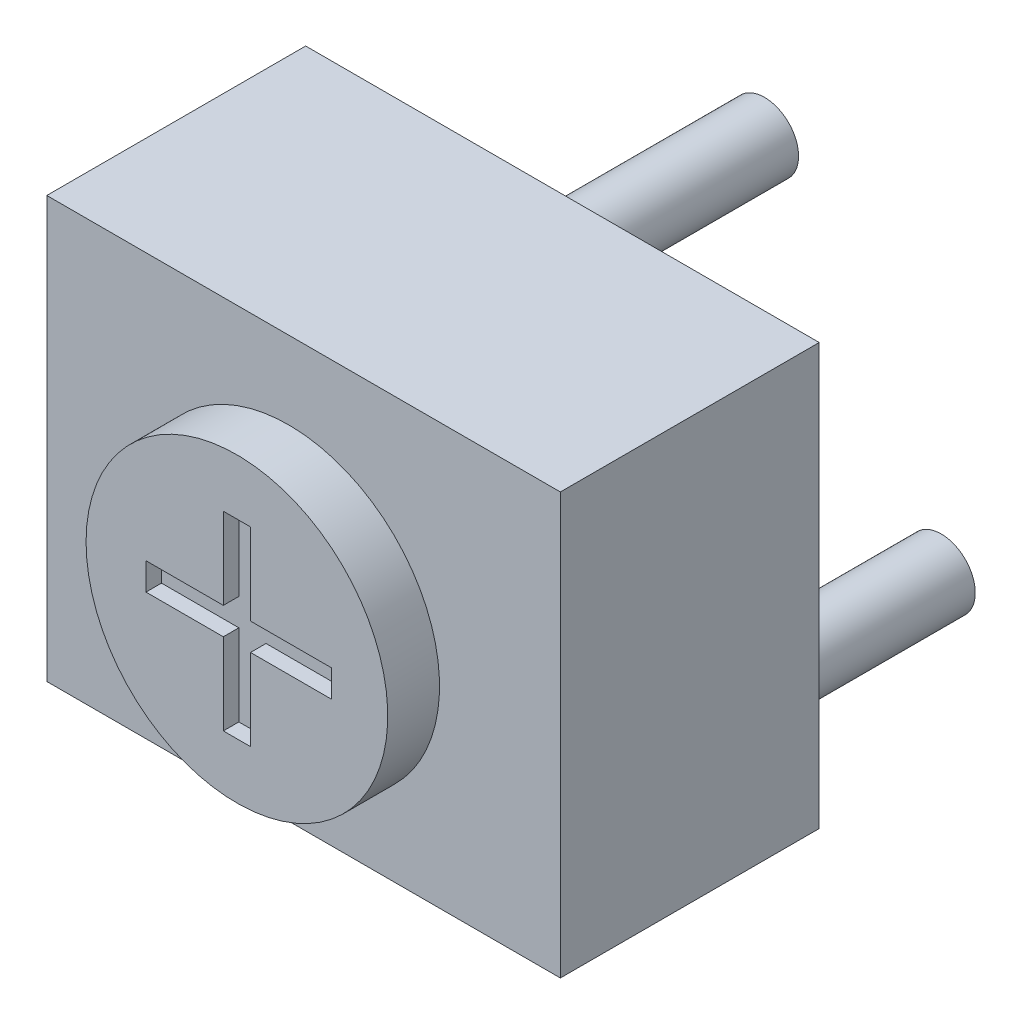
from build123d import *

# Parameters (mm, degrees)
ESQUISSE1_W                  = 7.55848073
ESQUISSE1_H                  = 6.19513229
EXTRUSION1_DEPTH             = 3.81
ESQUISSE2_R                  = 2.220084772
EXTRUSION2_DEPTH             = 0.762
ESQUISSE4_R                  = 0.5
EXTRUSION3_DEPTH             = 1.27
EXTRUSION3_DIRECTION_2_REACH = 55.202
ENL_V_MAT_EXTRU_1_DEPTH      = 0.2286


with BuildPart() as part:
    # Esquisse1 → Extrusion1 (new body)
    with BuildSketch(Plane.XY):
        with Locations((44.528886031, -18.324893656)):
            Rectangle(ESQUISSE1_W, ESQUISSE1_H)
    extrude(amount=EXTRUSION1_DEPTH)

    # Esquisse2 → Extrusion2 (add)
    with BuildSketch(Plane.XY.offset(3.81)):
        with Locations(Location((44.309534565, -18.591196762, 0), (0, 0, 180))):
            Circle(ESQUISSE2_R)
    extrude(amount=EXTRUSION2_DEPTH)

    # Esquisse4 → Extrusion3 (add)
    with BuildSketch(Plane(origin=(0, 0, -1.58), x_dir=(-1, 0, 0), z_dir=(0, 0, -1))):
        with Locations((-41.850277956, -20.119516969)):
            Circle(ESQUISSE4_R)
        with Locations((-44.654481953, -15.85461415)):
            Circle(ESQUISSE4_R)
        with Locations((-47.254559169, -20.119516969)):
            Circle(ESQUISSE4_R)
    extrude(amount=EXTRUSION3_DEPTH)

    # Esquisse4 → Extrusion3 direction 2 (add, up to next)
    with BuildSketch(Plane(origin=(0, 0, -1.58), x_dir=(-1, 0, 0), z_dir=(0, 0, -1)), mode=Mode.PRIVATE) as extrusion3_direction_2_sk1:
        with Locations((-41.850277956, -20.119516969)):
            Circle(ESQUISSE4_R)
    extrusion3_direction_2_tool1 = extrude(extrusion3_direction_2_sk1.sketch, amount=-EXTRUSION3_DIRECTION_2_REACH, mode=Mode.PRIVATE) - part.part
    # Esquisse4 → Extrusion3 direction 2 (add, up to next)
    with BuildSketch(Plane(origin=(0, 0, -1.58), x_dir=(-1, 0, 0), z_dir=(0, 0, -1)), mode=Mode.PRIVATE) as extrusion3_direction_2_sk2:
        with Locations((-44.654481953, -15.85461415)):
            Circle(ESQUISSE4_R)
    extrusion3_direction_2_tool2 = extrude(extrusion3_direction_2_sk2.sketch, amount=-EXTRUSION3_DIRECTION_2_REACH, mode=Mode.PRIVATE) - part.part
    # Esquisse4 → Extrusion3 direction 2 (add, up to next)
    with BuildSketch(Plane(origin=(0, 0, -1.58), x_dir=(-1, 0, 0), z_dir=(0, 0, -1)), mode=Mode.PRIVATE) as extrusion3_direction_2_sk3:
        with Locations((-47.254559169, -20.119516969)):
            Circle(ESQUISSE4_R)
    extrusion3_direction_2_tool3 = extrude(extrusion3_direction_2_sk3.sketch, amount=-EXTRUSION3_DIRECTION_2_REACH, mode=Mode.PRIVATE) - part.part
    add(extrusion3_direction_2_tool1.solids().sort_by_distance((41.850278, -20.119517, -1.58))[0])
    add(extrusion3_direction_2_tool2.solids().sort_by_distance((44.654482, -15.854614, -1.58))[0])
    add(extrusion3_direction_2_tool3.solids().sort_by_distance((47.254559, -20.119517, -1.58))[0])

    # Esquisse5 → Enl_v. mat.-Extru.1 (cut)
    with BuildSketch(Plane.XY.offset(4.572)):
        Polygon((45.700310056, -18.391196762), (45.700310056, -18.791196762), (44.509534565, -18.791196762), (44.509534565, -19.991444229), (44.109534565, -19.991444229), (44.109534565, -18.791196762), (42.971137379, -18.791196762), (42.971137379, -18.391196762), (44.109534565, -18.391196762), (44.109534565, -17.190949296), (44.509534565, -17.190949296), (44.509534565, -18.391196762), align=None)
    extrude(amount=-ENL_V_MAT_EXTRU_1_DEPTH, mode=Mode.SUBTRACT)


solid = part.part
